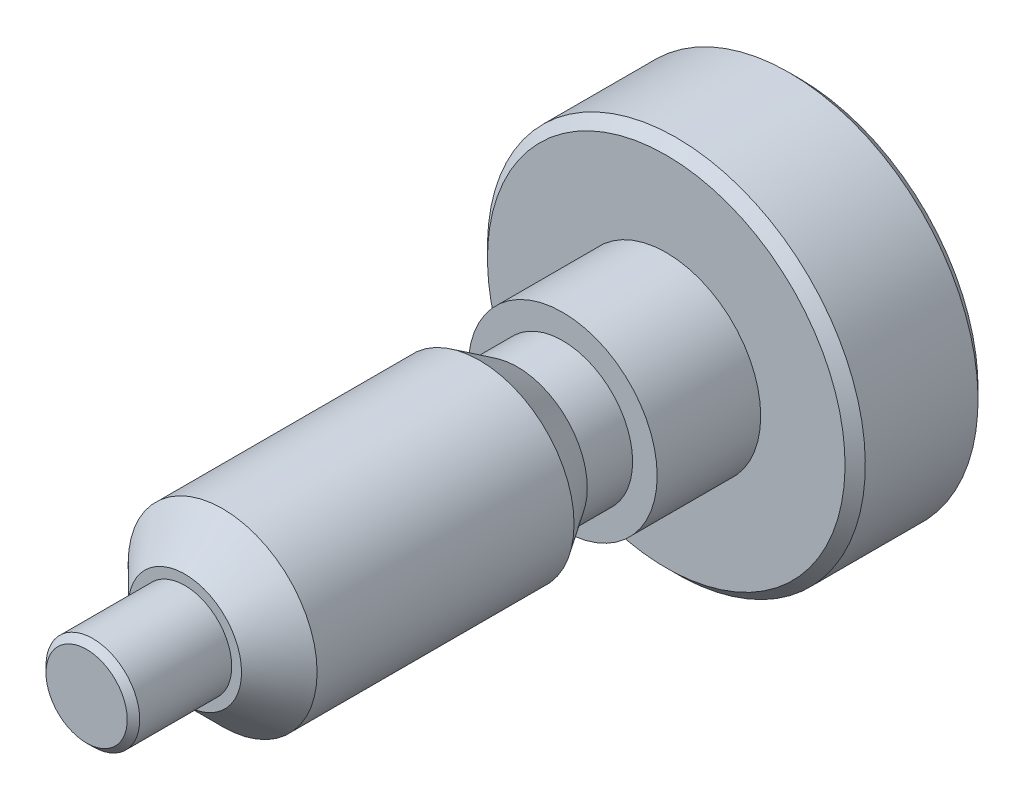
from build123d import *

# Parameters (mm, degrees)
SKETCH4_W     = 11.557
SKETCH4_H     = 1.5748
CHAMFER3_SIZE = 0.209973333


with BuildPart() as part:
    # Sketch2 → Revolve1 (revolve)
    with BuildSketch(Plane(origin=(0, 0, 0), x_dir=(0, 0, -1), z_dir=(1, 0, 0))):
        Polygon((7.5057, 3.175), (7.5057, 6.009277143), (7.846422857, 6.35), (11.635377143, 6.35), (11.9761, 6.009277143), (11.9761, 0), (4.0259, 0), (4.0259, 3.175), align=None)
    revolve(axis=Axis((0, 0, -11.9761), (0, 0, 1)))


with BuildPart() as body_2:
    # Sketch4 → Revolve2 (revolve)
    with BuildSketch(Plane(origin=(0, 0, 0), x_dir=(0, 0, -1), z_dir=(1, 0, 0))):
        with Locations((-6.1976, 0.7874)):
            Rectangle(SKETCH4_W, SKETCH4_H)
    revolve(axis=Axis((0, 0, 0.4191), (0, 0, 1)))

    # Chamfer3
    chamfer3_edges = [body_2.edges().sort_by_distance(p)[0] for p in [
        (0, -1.5748, 11.9761),
    ]]
    chamfer(chamfer3_edges, length=CHAMFER3_SIZE)


with BuildPart() as body_3:
    # Sketch5 → Revolve3 (revolve)
    with BuildSketch(Plane(origin=(0, 0, 0), x_dir=(0, 0, -1), z_dir=(1, 0, 0)), mode=Mode.PRIVATE) as revolve3_sk:
        Polygon((-8.6741, 1.5748), (-8.6741, 1.905), (-7.4041, 3.175), (1.2319, 3.175), (2.5019, 2.3495), (4.0259, 2.3495), (4.0259, 0), (-0.4191, 0), (-0.4191, 1.5748), align=None)
    revolve(revolve3_sk.sketch.rotate(Axis((0, 0, 11.9761), (0, 0, -1)), 90), axis=Axis((0, 0, 11.9761), (0, 0, -1)))


solid = Compound([part.part, body_2.part, body_3.part])
